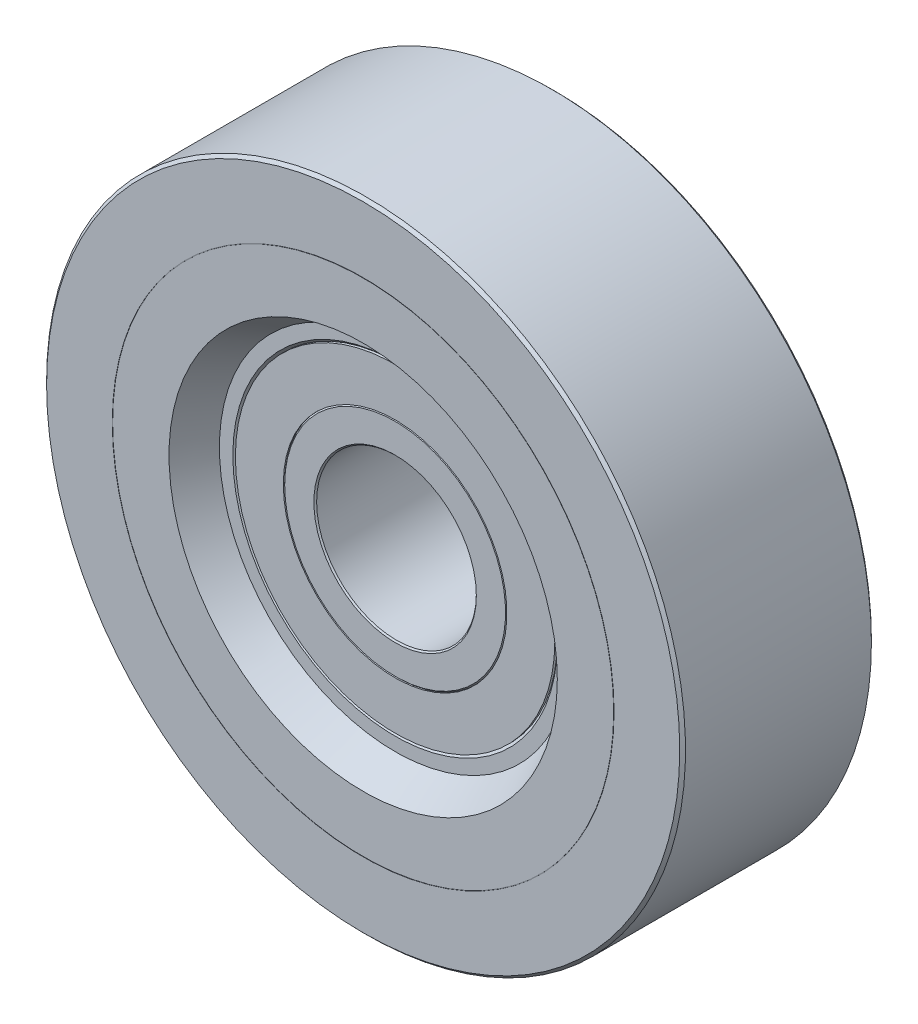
ISO-10303-21;
HEADER;
FILE_DESCRIPTION(('STEP AP214'),'2;1');
FILE_NAME('part.step','',(''),(''),'','','');
FILE_SCHEMA(('AUTOMOTIVE_DESIGN { 1 0 10303 214 1 1 1 1 }'));
ENDSEC;
DATA;
#1=APPLICATION_CONTEXT('core data for automotive mechanical design processes');
#2=APPLICATION_PROTOCOL_DEFINITION('international standard','automotive_design',2000,#1);
#3=PRODUCT_CONTEXT('',#1,'mechanical');
#4=PRODUCT('Part','Part','',(#3));
#5=PRODUCT_RELATED_PRODUCT_CATEGORY('part','',(#4));
#6=PRODUCT_DEFINITION_FORMATION('','',#4);
#7=PRODUCT_DEFINITION_CONTEXT('part definition',#1,'design');
#8=PRODUCT_DEFINITION('design','',#6,#7);
#9=PRODUCT_DEFINITION_SHAPE('','',#8);
#10=(LENGTH_UNIT() NAMED_UNIT(*) SI_UNIT(.MILLI.,.METRE.));
#11=(NAMED_UNIT(*) PLANE_ANGLE_UNIT() SI_UNIT($,.RADIAN.));
#12=(NAMED_UNIT(*) SI_UNIT($,.STERADIAN.) SOLID_ANGLE_UNIT());
#13=UNCERTAINTY_MEASURE_WITH_UNIT(LENGTH_MEASURE(1.E-05),#10,'distance_accuracy_value','');
#14=(GEOMETRIC_REPRESENTATION_CONTEXT(3) GLOBAL_UNCERTAINTY_ASSIGNED_CONTEXT((#13)) GLOBAL_UNIT_ASSIGNED_CONTEXT((#10,
#11,#12)) REPRESENTATION_CONTEXT('',''));
#15=CARTESIAN_POINT('',(0.,0.,0.));
#16=DIRECTION('',(0.,0.,1.));
#17=DIRECTION('',(1.,0.,0.));
#18=AXIS2_PLACEMENT_3D('',#15,#16,#17);
#19=CARTESIAN_POINT('',(0.,0.,-3.6));
#20=DIRECTION('',(0.,0.,-1.));
#21=DIRECTION('',(-1.,0.,0.));
#22=AXIS2_PLACEMENT_3D('',#19,#20,#21);
#23=CYLINDRICAL_SURFACE('',#22,7.);
#24=CARTESIAN_POINT('',(0.,0.,-4.));
#25=DIRECTION('',(0.,0.,-1.));
#26=DIRECTION('',(-1.,0.,0.));
#27=AXIS2_PLACEMENT_3D('',#24,#25,#26);
#28=CIRCLE('',#27,7.);
#29=CARTESIAN_POINT('',(-7.,0.,-4.));
#30=VERTEX_POINT('',#29);
#31=EDGE_CURVE('E55',#30,#30,#28,.F.);
#32=ORIENTED_EDGE('',*,*,#31,.F.);
#33=EDGE_LOOP('',(#32));
#34=FACE_BOUND('',#33,.T.);
#35=CARTESIAN_POINT('',(0.,0.,-3.91411042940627));
#36=DIRECTION('',(0.,0.,1.));
#37=DIRECTION('',(0.,1.,0.));
#38=AXIS2_PLACEMENT_3D('',#35,#36,#37);
#39=CIRCLE('',#38,7.000000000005);
#40=CARTESIAN_POINT('',(0.,7.000000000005,-3.91411042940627));
#41=VERTEX_POINT('',#40);
#42=EDGE_CURVE('E8',#41,#41,#39,.F.);
#43=ORIENTED_EDGE('',*,*,#42,.F.);
#44=EDGE_LOOP('',(#43));
#45=FACE_BOUND('',#44,.T.);
#46=ADVANCED_FACE('F12',(#34,#45),#23,.F.);
#47=CARTESIAN_POINT('',(0.,0.,-3.6));
#48=DIRECTION('',(0.,0.,-1.));
#49=DIRECTION('',(-1.,0.,0.));
#50=AXIS2_PLACEMENT_3D('',#47,#48,#49);
#51=CYLINDRICAL_SURFACE('',#50,10.);
#52=CARTESIAN_POINT('',(0.,0.,-3.84));
#53=DIRECTION('',(0.,0.,-1.));
#54=DIRECTION('',(0.,1.,0.));
#55=AXIS2_PLACEMENT_3D('',#52,#53,#54);
#56=CIRCLE('',#55,10.);
#57=CARTESIAN_POINT('',(0.,10.,-3.84));
#58=VERTEX_POINT('',#57);
#59=EDGE_CURVE('E20',#58,#58,#56,.T.);
#60=ORIENTED_EDGE('',*,*,#59,.T.);
#61=EDGE_LOOP('',(#60));
#62=FACE_BOUND('',#61,.T.);
#63=CARTESIAN_POINT('',(0.,0.,-4.));
#64=DIRECTION('',(0.,0.,-1.));
#65=DIRECTION('',(-1.,0.,0.));
#66=AXIS2_PLACEMENT_3D('',#63,#64,#65);
#67=CIRCLE('',#66,10.);
#68=CARTESIAN_POINT('',(-10.,0.,-4.));
#69=VERTEX_POINT('',#68);
#70=EDGE_CURVE('E25',#69,#69,#67,.F.);
#71=ORIENTED_EDGE('',*,*,#70,.T.);
#72=EDGE_LOOP('',(#71));
#73=FACE_BOUND('',#72,.T.);
#74=ADVANCED_FACE('F150',(#62,#73),#51,.T.);
#75=CARTESIAN_POINT('',(0.,8.5,-4.));
#76=DIRECTION('',(0.,0.,-1.));
#77=DIRECTION('',(-1.,0.,0.));
#78=AXIS2_PLACEMENT_3D('',#75,#76,#77);
#79=PLANE('',#78);
#80=ORIENTED_EDGE('',*,*,#31,.T.);
#81=EDGE_LOOP('',(#80));
#82=FACE_BOUND('',#81,.T.);
#83=ORIENTED_EDGE('',*,*,#70,.F.);
#84=EDGE_LOOP('',(#83));
#85=FACE_BOUND('',#84,.T.);
#86=ADVANCED_FACE('F157',(#82,#85),#79,.T.);
#87=CARTESIAN_POINT('',(0.,0.,5.99));
#88=DIRECTION('',(0.,0.,-1.));
#89=DIRECTION('',(-1.,0.,0.));
#90=AXIS2_PLACEMENT_3D('',#87,#88,#89);
#91=CYLINDRICAL_SURFACE('',#90,15.6865);
#92=CARTESIAN_POINT('',(0.,0.,6.));
#93=DIRECTION('',(0.,0.,-1.));
#94=DIRECTION('',(-1.,0.,0.));
#95=AXIS2_PLACEMENT_3D('',#92,#93,#94);
#96=CIRCLE('',#95,15.6865);
#97=CARTESIAN_POINT('',(-15.6865,0.,6.));
#98=VERTEX_POINT('',#97);
#99=EDGE_CURVE('E99',#98,#98,#96,.T.);
#100=ORIENTED_EDGE('',*,*,#99,.T.);
#101=EDGE_LOOP('',(#100));
#102=FACE_BOUND('',#101,.T.);
#103=CARTESIAN_POINT('',(0.,0.,5.98));
#104=DIRECTION('',(0.,0.,-1.));
#105=DIRECTION('',(-1.,0.,0.));
#106=AXIS2_PLACEMENT_3D('',#103,#104,#105);
#107=CIRCLE('',#106,15.6865);
#108=CARTESIAN_POINT('',(-15.6865,0.,5.98));
#109=VERTEX_POINT('',#108);
#110=EDGE_CURVE('E93',#109,#109,#107,.T.);
#111=ORIENTED_EDGE('',*,*,#110,.F.);
#112=EDGE_LOOP('',(#111));
#113=FACE_BOUND('',#112,.T.);
#114=ADVANCED_FACE('F165',(#102,#113),#91,.T.);
#115=CARTESIAN_POINT('',(0.,15.6965,5.98));
#116=DIRECTION('',(0.,0.,1.));
#117=DIRECTION('',(1.,0.,0.));
#118=AXIS2_PLACEMENT_3D('',#115,#116,#117);
#119=PLANE('',#118);
#120=CARTESIAN_POINT('',(0.,0.,5.98));
#121=DIRECTION('',(0.,0.,-1.));
#122=DIRECTION('',(-1.,0.,0.));
#123=AXIS2_PLACEMENT_3D('',#120,#121,#122);
#124=CIRCLE('',#123,15.7065);
#125=CARTESIAN_POINT('',(-15.7065,0.,5.98));
#126=VERTEX_POINT('',#125);
#127=EDGE_CURVE('E87',#126,#126,#124,.F.);
#128=ORIENTED_EDGE('',*,*,#127,.T.);
#129=EDGE_LOOP('',(#128));
#130=FACE_BOUND('',#129,.T.);
#131=ORIENTED_EDGE('',*,*,#110,.T.);
#132=EDGE_LOOP('',(#131));
#133=FACE_BOUND('',#132,.T.);
#134=ADVANCED_FACE('F204',(#130,#133),#119,.T.);
#135=CARTESIAN_POINT('',(0.,0.,5.99));
#136=DIRECTION('',(0.,0.,-1.));
#137=DIRECTION('',(-1.,0.,0.));
#138=AXIS2_PLACEMENT_3D('',#135,#136,#137);
#139=CYLINDRICAL_SURFACE('',#138,15.7065);
#140=ORIENTED_EDGE('',*,*,#127,.F.);
#141=EDGE_LOOP('',(#140));
#142=FACE_BOUND('',#141,.T.);
#143=CARTESIAN_POINT('',(0.,0.,6.));
#144=DIRECTION('',(0.,0.,-1.));
#145=DIRECTION('',(-1.,0.,0.));
#146=AXIS2_PLACEMENT_3D('',#143,#144,#145);
#147=CIRCLE('',#146,15.7065);
#148=CARTESIAN_POINT('',(-15.7065,0.,6.));
#149=VERTEX_POINT('',#148);
#150=EDGE_CURVE('E81',#149,#149,#147,.T.);
#151=ORIENTED_EDGE('',*,*,#150,.F.);
#152=EDGE_LOOP('',(#151));
#153=FACE_BOUND('',#152,.T.);
#154=ADVANCED_FACE('F196',(#142,#153),#139,.F.);
#155=CARTESIAN_POINT('',(0.,17.7631599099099,6.));
#156=DIRECTION('',(0.,0.,1.));
#157=DIRECTION('',(1.,0.,0.));
#158=AXIS2_PLACEMENT_3D('',#155,#156,#157);
#159=PLANE('',#158);
#160=CARTESIAN_POINT('',(0.,0.,6.));
#161=DIRECTION('',(0.,0.,-1.));
#162=DIRECTION('',(-1.,0.,0.));
#163=AXIS2_PLACEMENT_3D('',#160,#161,#162);
#164=CIRCLE('',#163,19.8198198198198);
#165=CARTESIAN_POINT('',(-19.8198198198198,0.,6.));
#166=VERTEX_POINT('',#165);
#167=EDGE_CURVE('E75',#166,#166,#164,.T.);
#168=ORIENTED_EDGE('',*,*,#167,.F.);
#169=EDGE_LOOP('',(#168));
#170=FACE_BOUND('',#169,.T.);
#171=ORIENTED_EDGE('',*,*,#150,.T.);
#172=EDGE_LOOP('',(#171));
#173=FACE_BOUND('',#172,.T.);
#174=ADVANCED_FACE('F188',(#170,#173),#159,.T.);
#175=CARTESIAN_POINT('',(0.,0.,5.81981981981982));
#176=DIRECTION('',(0.,0.,-1.));
#177=DIRECTION('',(-1.,0.,0.));
#178=AXIS2_PLACEMENT_3D('',#175,#176,#177);
#179=CONICAL_SURFACE('',#178,20.,0.785398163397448);
#180=ORIENTED_EDGE('',*,*,#167,.T.);
#181=EDGE_LOOP('',(#180));
#182=FACE_BOUND('',#181,.T.);
#183=CARTESIAN_POINT('',(0.,0.,5.81981981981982));
#184=DIRECTION('',(0.,0.,-1.));
#185=DIRECTION('',(-1.,0.,0.));
#186=AXIS2_PLACEMENT_3D('',#183,#184,#185);
#187=CIRCLE('',#186,20.);
#188=CARTESIAN_POINT('',(-20.,0.,5.81981981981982));
#189=VERTEX_POINT('',#188);
#190=EDGE_CURVE('E65',#189,#189,#187,.T.);
#191=ORIENTED_EDGE('',*,*,#190,.F.);
#192=EDGE_LOOP('',(#191));
#193=FACE_BOUND('',#192,.T.);
#194=ADVANCED_FACE('F180',(#182,#193),#179,.T.);
#195=CARTESIAN_POINT('',(0.,0.,0.));
#196=DIRECTION('',(0.,0.,-1.));
#197=DIRECTION('',(-1.,0.,0.));
#198=AXIS2_PLACEMENT_3D('',#195,#196,#197);
#199=CYLINDRICAL_SURFACE('',#198,20.);
#200=ORIENTED_EDGE('',*,*,#190,.T.);
#201=EDGE_LOOP('',(#200));
#202=FACE_BOUND('',#201,.T.);
#203=CARTESIAN_POINT('',(0.,0.,-5.8198198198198));
#204=DIRECTION('',(0.,0.,-1.));
#205=DIRECTION('',(-1.,0.,0.));
#206=AXIS2_PLACEMENT_3D('',#203,#204,#205);
#207=CIRCLE('',#206,20.);
#208=CARTESIAN_POINT('',(-20.,0.,-5.8198198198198));
#209=VERTEX_POINT('',#208);
#210=EDGE_CURVE('E68',#209,#209,#207,.F.);
#211=ORIENTED_EDGE('',*,*,#210,.T.);
#212=EDGE_LOOP('',(#211));
#213=FACE_BOUND('',#212,.T.);
#214=ADVANCED_FACE('F176',(#202,#213),#199,.T.);
#215=CARTESIAN_POINT('',(0.,0.,-5.8198198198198));
#216=DIRECTION('',(0.,0.,1.));
#217=DIRECTION('',(1.,0.,0.));
#218=AXIS2_PLACEMENT_3D('',#215,#216,#217);
#219=CONICAL_SURFACE('',#218,20.,0.785398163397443);
#220=CARTESIAN_POINT('',(0.,0.,-6.));
#221=DIRECTION('',(0.,0.,1.));
#222=DIRECTION('',(1.,0.,0.));
#223=AXIS2_PLACEMENT_3D('',#220,#221,#222);
#224=CIRCLE('',#223,19.8198198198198);
#225=CARTESIAN_POINT('',(19.8198198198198,0.,-6.));
#226=VERTEX_POINT('',#225);
#227=EDGE_CURVE('E69',#226,#226,#224,.T.);
#228=ORIENTED_EDGE('',*,*,#227,.T.);
#229=EDGE_LOOP('',(#228));
#230=FACE_BOUND('',#229,.T.);
#231=ORIENTED_EDGE('',*,*,#210,.F.);
#232=EDGE_LOOP('',(#231));
#233=FACE_BOUND('',#232,.T.);
#234=ADVANCED_FACE('F179',(#230,#233),#219,.T.);
#235=CARTESIAN_POINT('',(0.,17.7631599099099,-6.));
#236=DIRECTION('',(0.,0.,-1.));
#237=DIRECTION('',(-1.,0.,0.));
#238=AXIS2_PLACEMENT_3D('',#235,#236,#237);
#239=PLANE('',#238);
#240=CARTESIAN_POINT('',(0.,0.,-6.));
#241=DIRECTION('',(0.,0.,-1.));
#242=DIRECTION('',(-1.,0.,0.));
#243=AXIS2_PLACEMENT_3D('',#240,#241,#242);
#244=CIRCLE('',#243,15.7065);
#245=CARTESIAN_POINT('',(-15.7065,0.,-6.));
#246=VERTEX_POINT('',#245);
#247=EDGE_CURVE('E78',#246,#246,#244,.F.);
#248=ORIENTED_EDGE('',*,*,#247,.T.);
#249=EDGE_LOOP('',(#248));
#250=FACE_BOUND('',#249,.T.);
#251=ORIENTED_EDGE('',*,*,#227,.F.);
#252=EDGE_LOOP('',(#251));
#253=FACE_BOUND('',#252,.T.);
#254=ADVANCED_FACE('F184',(#250,#253),#239,.T.);
#255=CARTESIAN_POINT('',(0.,0.,-5.99));
#256=DIRECTION('',(0.,0.,-1.));
#257=DIRECTION('',(-1.,0.,0.));
#258=AXIS2_PLACEMENT_3D('',#255,#256,#257);
#259=CYLINDRICAL_SURFACE('',#258,15.7065);
#260=ORIENTED_EDGE('',*,*,#247,.F.);
#261=EDGE_LOOP('',(#260));
#262=FACE_BOUND('',#261,.T.);
#263=CARTESIAN_POINT('',(0.,0.,-5.98));
#264=DIRECTION('',(0.,0.,-1.));
#265=DIRECTION('',(-1.,0.,0.));
#266=AXIS2_PLACEMENT_3D('',#263,#264,#265);
#267=CIRCLE('',#266,15.7065);
#268=CARTESIAN_POINT('',(-15.7065,0.,-5.98));
#269=VERTEX_POINT('',#268);
#270=EDGE_CURVE('E84',#269,#269,#267,.T.);
#271=ORIENTED_EDGE('',*,*,#270,.F.);
#272=EDGE_LOOP('',(#271));
#273=FACE_BOUND('',#272,.T.);
#274=ADVANCED_FACE('F192',(#262,#273),#259,.F.);
#275=CARTESIAN_POINT('',(0.,15.6965,-5.98));
#276=DIRECTION('',(0.,0.,-1.));
#277=DIRECTION('',(-1.,0.,0.));
#278=AXIS2_PLACEMENT_3D('',#275,#276,#277);
#279=PLANE('',#278);
#280=CARTESIAN_POINT('',(0.,0.,-5.98));
#281=DIRECTION('',(0.,0.,-1.));
#282=DIRECTION('',(-1.,0.,0.));
#283=AXIS2_PLACEMENT_3D('',#280,#281,#282);
#284=CIRCLE('',#283,15.6865);
#285=CARTESIAN_POINT('',(-15.6865,0.,-5.98));
#286=VERTEX_POINT('',#285);
#287=EDGE_CURVE('E90',#286,#286,#284,.F.);
#288=ORIENTED_EDGE('',*,*,#287,.T.);
#289=EDGE_LOOP('',(#288));
#290=FACE_BOUND('',#289,.T.);
#291=ORIENTED_EDGE('',*,*,#270,.T.);
#292=EDGE_LOOP('',(#291));
#293=FACE_BOUND('',#292,.T.);
#294=ADVANCED_FACE('F200',(#290,#293),#279,.T.);
#295=CARTESIAN_POINT('',(0.,0.,-5.99));
#296=DIRECTION('',(0.,0.,-1.));
#297=DIRECTION('',(-1.,0.,0.));
#298=AXIS2_PLACEMENT_3D('',#295,#296,#297);
#299=CYLINDRICAL_SURFACE('',#298,15.6865);
#300=ORIENTED_EDGE('',*,*,#287,.F.);
#301=EDGE_LOOP('',(#300));
#302=FACE_BOUND('',#301,.T.);
#303=CARTESIAN_POINT('',(0.,0.,-6.));
#304=DIRECTION('',(0.,0.,-1.));
#305=DIRECTION('',(-1.,0.,0.));
#306=AXIS2_PLACEMENT_3D('',#303,#304,#305);
#307=CIRCLE('',#306,15.6865);
#308=CARTESIAN_POINT('',(-15.6865,0.,-6.));
#309=VERTEX_POINT('',#308);
#310=EDGE_CURVE('E96',#309,#309,#307,.F.);
#311=ORIENTED_EDGE('',*,*,#310,.T.);
#312=EDGE_LOOP('',(#311));
#313=FACE_BOUND('',#312,.T.);
#314=ADVANCED_FACE('F208',(#302,#313),#299,.T.);
#315=CARTESIAN_POINT('',(0.,13.9206002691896,-6.));
#316=DIRECTION('',(0.,0.,-1.));
#317=DIRECTION('',(-1.,0.,0.));
#318=AXIS2_PLACEMENT_3D('',#315,#316,#317);
#319=PLANE('',#318);
#320=CARTESIAN_POINT('',(0.,0.,-6.));
#321=DIRECTION('',(0.,0.,-1.));
#322=DIRECTION('',(-1.,0.,0.));
#323=AXIS2_PLACEMENT_3D('',#320,#321,#322);
#324=CIRCLE('',#323,12.1547005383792);
#325=CARTESIAN_POINT('',(-12.1547005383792,0.,-6.));
#326=VERTEX_POINT('',#325);
#327=EDGE_CURVE('E102',#326,#326,#324,.F.);
#328=ORIENTED_EDGE('',*,*,#327,.T.);
#329=EDGE_LOOP('',(#328));
#330=FACE_BOUND('',#329,.T.);
#331=ORIENTED_EDGE('',*,*,#310,.F.);
#332=EDGE_LOOP('',(#331));
#333=FACE_BOUND('',#332,.T.);
#334=ADVANCED_FACE('F215',(#330,#333),#319,.T.);
#335=CARTESIAN_POINT('',(0.,0.,-6.));
#336=DIRECTION('',(0.,0.,-1.));
#337=DIRECTION('',(-1.,0.,0.));
#338=AXIS2_PLACEMENT_3D('',#335,#336,#337);
#339=CONICAL_SURFACE('',#338,12.1547005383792,0.523598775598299);
#340=ORIENTED_EDGE('',*,*,#327,.F.);
#341=EDGE_LOOP('',(#340));
#342=FACE_BOUND('',#341,.T.);
#343=CARTESIAN_POINT('',(0.,0.,-4.));
#344=DIRECTION('',(0.,0.,-1.));
#345=DIRECTION('',(-1.,0.,0.));
#346=AXIS2_PLACEMENT_3D('',#343,#344,#345);
#347=CIRCLE('',#346,11.);
#348=CARTESIAN_POINT('',(-11.,0.,-4.));
#349=VERTEX_POINT('',#348);
#350=EDGE_CURVE('E108',#349,#349,#347,.T.);
#351=ORIENTED_EDGE('',*,*,#350,.F.);
#352=EDGE_LOOP('',(#351));
#353=FACE_BOUND('',#352,.T.);
#354=ADVANCED_FACE('F222',(#342,#353),#339,.F.);
#355=CARTESIAN_POINT('',(0.,10.58,-4.));
#356=DIRECTION('',(0.,0.,-1.));
#357=DIRECTION('',(-1.,0.,0.));
#358=AXIS2_PLACEMENT_3D('',#355,#356,#357);
#359=PLANE('',#358);
#360=CARTESIAN_POINT('',(0.,0.,-4.));
#361=DIRECTION('',(0.,0.,-1.));
#362=DIRECTION('',(-1.,0.,0.));
#363=AXIS2_PLACEMENT_3D('',#360,#361,#362);
#364=CIRCLE('',#363,10.16);
#365=CARTESIAN_POINT('',(-10.16,0.,-4.));
#366=VERTEX_POINT('',#365);
#367=EDGE_CURVE('E114',#366,#366,#364,.F.);
#368=ORIENTED_EDGE('',*,*,#367,.T.);
#369=EDGE_LOOP('',(#368));
#370=FACE_BOUND('',#369,.T.);
#371=ORIENTED_EDGE('',*,*,#350,.T.);
#372=EDGE_LOOP('',(#371));
#373=FACE_BOUND('',#372,.T.);
#374=ADVANCED_FACE('F231',(#370,#373),#359,.T.);
#375=CARTESIAN_POINT('',(0.,0.,-4.));
#376=DIRECTION('',(0.,0.,-1.));
#377=DIRECTION('',(-1.,0.,0.));
#378=AXIS2_PLACEMENT_3D('',#375,#376,#377);
#379=CONICAL_SURFACE('',#378,10.16,0.785398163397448);
#380=ORIENTED_EDGE('',*,*,#367,.F.);
#381=EDGE_LOOP('',(#380));
#382=FACE_BOUND('',#381,.T.);
#383=ORIENTED_EDGE('',*,*,#59,.F.);
#384=EDGE_LOOP('',(#383));
#385=FACE_BOUND('',#384,.T.);
#386=ADVANCED_FACE('F148',(#382,#385),#379,.F.);
#387=CARTESIAN_POINT('',(0.,13.9206002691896,6.));
#388=DIRECTION('',(0.,0.,1.));
#389=DIRECTION('',(1.,0.,0.));
#390=AXIS2_PLACEMENT_3D('',#387,#388,#389);
#391=PLANE('',#390);
#392=ORIENTED_EDGE('',*,*,#99,.F.);
#393=EDGE_LOOP('',(#392));
#394=FACE_BOUND('',#393,.T.);
#395=CARTESIAN_POINT('',(0.,0.,6.));
#396=DIRECTION('',(0.,0.,1.));
#397=DIRECTION('',(1.,0.,0.));
#398=AXIS2_PLACEMENT_3D('',#395,#396,#397);
#399=CIRCLE('',#398,12.1547005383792);
#400=CARTESIAN_POINT('',(12.1547005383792,0.,6.));
#401=VERTEX_POINT('',#400);
#402=EDGE_CURVE('E105',#401,#401,#399,.F.);
#403=ORIENTED_EDGE('',*,*,#402,.T.);
#404=EDGE_LOOP('',(#403));
#405=FACE_BOUND('',#404,.T.);
#406=ADVANCED_FACE('F224',(#394,#405),#391,.T.);
#407=CARTESIAN_POINT('',(0.,0.,6.));
#408=DIRECTION('',(0.,0.,1.));
#409=DIRECTION('',(1.,0.,0.));
#410=AXIS2_PLACEMENT_3D('',#407,#408,#409);
#411=CONICAL_SURFACE('',#410,12.1547005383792,0.523598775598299);
#412=CARTESIAN_POINT('',(0.,0.,4.));
#413=DIRECTION('',(0.,0.,1.));
#414=DIRECTION('',(1.,0.,0.));
#415=AXIS2_PLACEMENT_3D('',#412,#413,#414);
#416=CIRCLE('',#415,11.);
#417=CARTESIAN_POINT('',(11.,0.,4.));
#418=VERTEX_POINT('',#417);
#419=EDGE_CURVE('E111',#418,#418,#416,.T.);
#420=ORIENTED_EDGE('',*,*,#419,.F.);
#421=EDGE_LOOP('',(#420));
#422=FACE_BOUND('',#421,.T.);
#423=ORIENTED_EDGE('',*,*,#402,.F.);
#424=EDGE_LOOP('',(#423));
#425=FACE_BOUND('',#424,.T.);
#426=ADVANCED_FACE('F227',(#422,#425),#411,.F.);
#427=CARTESIAN_POINT('',(0.,10.58,4.));
#428=DIRECTION('',(0.,0.,1.));
#429=DIRECTION('',(1.,0.,0.));
#430=AXIS2_PLACEMENT_3D('',#427,#428,#429);
#431=PLANE('',#430);
#432=ORIENTED_EDGE('',*,*,#419,.T.);
#433=EDGE_LOOP('',(#432));
#434=FACE_BOUND('',#433,.T.);
#435=CARTESIAN_POINT('',(0.,0.,4.));
#436=DIRECTION('',(0.,0.,1.));
#437=DIRECTION('',(1.,0.,0.));
#438=AXIS2_PLACEMENT_3D('',#435,#436,#437);
#439=CIRCLE('',#438,10.16);
#440=CARTESIAN_POINT('',(10.16,0.,4.));
#441=VERTEX_POINT('',#440);
#442=EDGE_CURVE('E117',#441,#441,#439,.F.);
#443=ORIENTED_EDGE('',*,*,#442,.T.);
#444=EDGE_LOOP('',(#443));
#445=FACE_BOUND('',#444,.T.);
#446=ADVANCED_FACE('F146',(#434,#445),#431,.T.);
#447=CARTESIAN_POINT('',(0.,0.,4.));
#448=DIRECTION('',(0.,0.,1.));
#449=DIRECTION('',(1.,0.,0.));
#450=AXIS2_PLACEMENT_3D('',#447,#448,#449);
#451=CONICAL_SURFACE('',#450,10.16,0.785398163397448);
#452=CARTESIAN_POINT('',(0.,0.,3.84));
#453=DIRECTION('',(0.,0.,1.));
#454=DIRECTION('',(1.,0.,0.));
#455=AXIS2_PLACEMENT_3D('',#452,#453,#454);
#456=CIRCLE('',#455,10.);
#457=CARTESIAN_POINT('',(10.,0.,3.84));
#458=VERTEX_POINT('',#457);
#459=EDGE_CURVE('E56',#458,#458,#456,.T.);
#460=ORIENTED_EDGE('',*,*,#459,.F.);
#461=EDGE_LOOP('',(#460));
#462=FACE_BOUND('',#461,.T.);
#463=ORIENTED_EDGE('',*,*,#442,.F.);
#464=EDGE_LOOP('',(#463));
#465=FACE_BOUND('',#464,.T.);
#466=ADVANCED_FACE('F132',(#462,#465),#451,.F.);
#467=CARTESIAN_POINT('',(0.,0.,3.6));
#468=DIRECTION('',(0.,0.,-1.));
#469=DIRECTION('',(-1.,0.,0.));
#470=AXIS2_PLACEMENT_3D('',#467,#468,#469);
#471=CYLINDRICAL_SURFACE('',#470,10.);
#472=CARTESIAN_POINT('',(0.,0.,4.));
#473=DIRECTION('',(0.,0.,-1.));
#474=DIRECTION('',(-1.,0.,0.));
#475=AXIS2_PLACEMENT_3D('',#472,#473,#474);
#476=CIRCLE('',#475,10.);
#477=CARTESIAN_POINT('',(-10.,0.,4.));
#478=VERTEX_POINT('',#477);
#479=EDGE_CURVE('E61',#478,#478,#476,.F.);
#480=ORIENTED_EDGE('',*,*,#479,.F.);
#481=EDGE_LOOP('',(#480));
#482=FACE_BOUND('',#481,.T.);
#483=ORIENTED_EDGE('',*,*,#459,.T.);
#484=EDGE_LOOP('',(#483));
#485=FACE_BOUND('',#484,.T.);
#486=ADVANCED_FACE('F145',(#482,#485),#471,.T.);
#487=CARTESIAN_POINT('',(0.,8.5,4.));
#488=DIRECTION('',(0.,0.,1.));
#489=DIRECTION('',(1.,0.,0.));
#490=AXIS2_PLACEMENT_3D('',#487,#488,#489);
#491=PLANE('',#490);
#492=ORIENTED_EDGE('',*,*,#479,.T.);
#493=EDGE_LOOP('',(#492));
#494=FACE_BOUND('',#493,.T.);
#495=CARTESIAN_POINT('',(0.,0.,4.));
#496=DIRECTION('',(0.,0.,-1.));
#497=DIRECTION('',(-1.,0.,0.));
#498=AXIS2_PLACEMENT_3D('',#495,#496,#497);
#499=CIRCLE('',#498,7.);
#500=CARTESIAN_POINT('',(-7.,0.,4.));
#501=VERTEX_POINT('',#500);
#502=EDGE_CURVE('E71',#501,#501,#499,.T.);
#503=ORIENTED_EDGE('',*,*,#502,.T.);
#504=EDGE_LOOP('',(#503));
#505=FACE_BOUND('',#504,.T.);
#506=ADVANCED_FACE('F167',(#494,#505),#491,.T.);
#507=CARTESIAN_POINT('',(0.,0.,3.6));
#508=DIRECTION('',(0.,0.,-1.));
#509=DIRECTION('',(-1.,0.,0.));
#510=AXIS2_PLACEMENT_3D('',#507,#508,#509);
#511=CYLINDRICAL_SURFACE('',#510,7.);
#512=CARTESIAN_POINT('',(0.,0.,3.91411042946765));
#513=DIRECTION('',(0.,0.,-1.));
#514=DIRECTION('',(-1.,0.,0.));
#515=AXIS2_PLACEMENT_3D('',#512,#513,#514);
#516=CIRCLE('',#515,7.);
#517=CARTESIAN_POINT('',(-7.,0.,3.91411042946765));
#518=VERTEX_POINT('',#517);
#519=EDGE_CURVE('E53',#518,#518,#516,.T.);
#520=ORIENTED_EDGE('',*,*,#519,.T.);
#521=EDGE_LOOP('',(#520));
#522=FACE_BOUND('',#521,.T.);
#523=ORIENTED_EDGE('',*,*,#502,.F.);
#524=EDGE_LOOP('',(#523));
#525=FACE_BOUND('',#524,.T.);
#526=ADVANCED_FACE('F49',(#522,#525),#511,.F.);
#527=CARTESIAN_POINT('',(0.,0.,3.91411042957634));
#528=DIRECTION('',(0.,0.,-1.));
#529=DIRECTION('',(-1.,0.,0.));
#530=AXIS2_PLACEMENT_3D('',#527,#528,#529);
#531=CONICAL_SURFACE('',#530,6.99999999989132,0.785398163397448);
#532=CARTESIAN_POINT('',(0.,0.,4.0000000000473));
#533=DIRECTION('',(0.,0.,-1.));
#534=DIRECTION('',(-1.,0.,0.));
#535=AXIS2_PLACEMENT_3D('',#532,#533,#534);
#536=CIRCLE('',#535,6.91411042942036);
#537=CARTESIAN_POINT('',(-6.91411042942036,0.,4.0000000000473));
#538=VERTEX_POINT('',#537);
#539=EDGE_CURVE('E16',#538,#538,#536,.F.);
#540=ORIENTED_EDGE('',*,*,#539,.F.);
#541=EDGE_LOOP('',(#540));
#542=FACE_BOUND('',#541,.T.);
#543=ORIENTED_EDGE('',*,*,#519,.F.);
#544=EDGE_LOOP('',(#543));
#545=FACE_BOUND('',#544,.T.);
#546=ADVANCED_FACE('F14',(#542,#545),#531,.T.);
#547=CARTESIAN_POINT('',(0.,6.,4.));
#548=DIRECTION('',(0.,0.,1.));
#549=DIRECTION('',(1.,0.,0.));
#550=AXIS2_PLACEMENT_3D('',#547,#548,#549);
#551=PLANE('',#550);
#552=ORIENTED_EDGE('',*,*,#539,.T.);
#553=EDGE_LOOP('',(#552));
#554=FACE_BOUND('',#553,.T.);
#555=CARTESIAN_POINT('',(0.,0.,4.0000000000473));
#556=DIRECTION('',(0.,0.,1.));
#557=DIRECTION('',(1.,0.,0.));
#558=AXIS2_PLACEMENT_3D('',#555,#556,#557);
#559=CIRCLE('',#558,5.08588957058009);
#560=CARTESIAN_POINT('',(5.08588957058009,0.,4.0000000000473));
#561=VERTEX_POINT('',#560);
#562=EDGE_CURVE('E35',#561,#561,#559,.F.);
#563=ORIENTED_EDGE('',*,*,#562,.T.);
#564=EDGE_LOOP('',(#563));
#565=FACE_BOUND('',#564,.T.);
#566=ADVANCED_FACE('F44',(#554,#565),#551,.T.);
#567=CARTESIAN_POINT('',(0.,0.,4.0000000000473));
#568=DIRECTION('',(0.,0.,1.));
#569=DIRECTION('',(1.,0.,0.));
#570=AXIS2_PLACEMENT_3D('',#567,#568,#569);
#571=CONICAL_SURFACE('',#570,5.08588957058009,0.785398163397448);
#572=CARTESIAN_POINT('',(0.,0.,3.91411042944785));
#573=DIRECTION('',(0.,0.,-1.));
#574=DIRECTION('',(-1.,0.,0.));
#575=AXIS2_PLACEMENT_3D('',#572,#573,#574);
#576=CIRCLE('',#575,5.);
#577=CARTESIAN_POINT('',(-5.,0.,3.91411042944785));
#578=VERTEX_POINT('',#577);
#579=EDGE_CURVE('E34',#578,#578,#576,.T.);
#580=ORIENTED_EDGE('',*,*,#579,.T.);
#581=EDGE_LOOP('',(#580));
#582=FACE_BOUND('',#581,.T.);
#583=ORIENTED_EDGE('',*,*,#562,.F.);
#584=EDGE_LOOP('',(#583));
#585=FACE_BOUND('',#584,.T.);
#586=ADVANCED_FACE('F130',(#582,#585),#571,.F.);
#587=CARTESIAN_POINT('',(0.,0.,0.));
#588=DIRECTION('',(0.,0.,-1.));
#589=DIRECTION('',(-1.,0.,0.));
#590=AXIS2_PLACEMENT_3D('',#587,#588,#589);
#591=CYLINDRICAL_SURFACE('',#590,5.);
#592=CARTESIAN_POINT('',(0.,0.,-3.91411042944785));
#593=DIRECTION('',(0.,0.,-1.));
#594=DIRECTION('',(-1.,0.,0.));
#595=AXIS2_PLACEMENT_3D('',#592,#593,#594);
#596=CIRCLE('',#595,5.);
#597=CARTESIAN_POINT('',(-5.,0.,-3.91411042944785));
#598=VERTEX_POINT('',#597);
#599=EDGE_CURVE('E29',#598,#598,#596,.F.);
#600=ORIENTED_EDGE('',*,*,#599,.F.);
#601=EDGE_LOOP('',(#600));
#602=FACE_BOUND('',#601,.T.);
#603=ORIENTED_EDGE('',*,*,#579,.F.);
#604=EDGE_LOOP('',(#603));
#605=FACE_BOUND('',#604,.T.);
#606=ADVANCED_FACE('F127',(#602,#605),#591,.F.);
#607=CARTESIAN_POINT('',(0.,0.,-3.99999999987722));
#608=DIRECTION('',(0.,0.,-1.));
#609=DIRECTION('',(-1.,0.,0.));
#610=AXIS2_PLACEMENT_3D('',#607,#608,#609);
#611=CONICAL_SURFACE('',#610,5.08588957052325,0.785398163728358);
#612=CARTESIAN_POINT('',(0.,0.,-3.99999999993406));
#613=DIRECTION('',(0.,0.,-1.));
#614=DIRECTION('',(-1.,0.,0.));
#615=AXIS2_PLACEMENT_3D('',#612,#613,#614);
#616=CIRCLE('',#615,5.08588957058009);
#617=CARTESIAN_POINT('',(-5.08588957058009,0.,-3.99999999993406));
#618=VERTEX_POINT('',#617);
#619=EDGE_CURVE('E31',#618,#618,#616,.F.);
#620=ORIENTED_EDGE('',*,*,#619,.F.);
#621=EDGE_LOOP('',(#620));
#622=FACE_BOUND('',#621,.T.);
#623=ORIENTED_EDGE('',*,*,#599,.T.);
#624=EDGE_LOOP('',(#623));
#625=FACE_BOUND('',#624,.T.);
#626=ADVANCED_FACE('F125',(#622,#625),#611,.F.);
#627=CARTESIAN_POINT('',(0.,6.,-4.));
#628=DIRECTION('',(0.,0.,-1.));
#629=DIRECTION('',(-1.,0.,0.));
#630=AXIS2_PLACEMENT_3D('',#627,#628,#629);
#631=PLANE('',#630);
#632=ORIENTED_EDGE('',*,*,#619,.T.);
#633=EDGE_LOOP('',(#632));
#634=FACE_BOUND('',#633,.T.);
#635=CARTESIAN_POINT('',(0.,0.,-4.00000000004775));
#636=DIRECTION('',(0.,0.,1.));
#637=DIRECTION('',(1.,0.,0.));
#638=AXIS2_PLACEMENT_3D('',#635,#636,#637);
#639=CIRCLE('',#638,6.91411042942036);
#640=CARTESIAN_POINT('',(6.91411042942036,0.,-4.00000000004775));
#641=VERTEX_POINT('',#640);
#642=EDGE_CURVE('E37',#641,#641,#639,.F.);
#643=ORIENTED_EDGE('',*,*,#642,.T.);
#644=EDGE_LOOP('',(#643));
#645=FACE_BOUND('',#644,.T.);
#646=ADVANCED_FACE('F139',(#634,#645),#631,.T.);
#647=CARTESIAN_POINT('',(0.,0.,-3.91411042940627));
#648=DIRECTION('',(0.,0.,1.));
#649=DIRECTION('',(1.,0.,0.));
#650=AXIS2_PLACEMENT_3D('',#647,#648,#649);
#651=CONICAL_SURFACE('',#650,7.000000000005,0.785398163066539);
#652=ORIENTED_EDGE('',*,*,#42,.T.);
#653=EDGE_LOOP('',(#652));
#654=FACE_BOUND('',#653,.T.);
#655=ORIENTED_EDGE('',*,*,#642,.F.);
#656=EDGE_LOOP('',(#655));
#657=FACE_BOUND('',#656,.T.);
#658=ADVANCED_FACE('F50',(#654,#657),#651,.T.);
#659=CLOSED_SHELL('',(#46,#74,#86,#114,#134,#154,#174,#194,#214,#234,#254,#274,#294,#314,#334,
#354,#374,#386,#406,#426,#446,#466,#486,#506,#526,#546,#566,#586,#606,#626,#646,#658));
#660=MANIFOLD_SOLID_BREP('B1',#659);
#661=ADVANCED_BREP_SHAPE_REPRESENTATION('',(#18,#660),#14);
#662=SHAPE_DEFINITION_REPRESENTATION(#9,#661);
ENDSEC;
END-ISO-10303-21;
